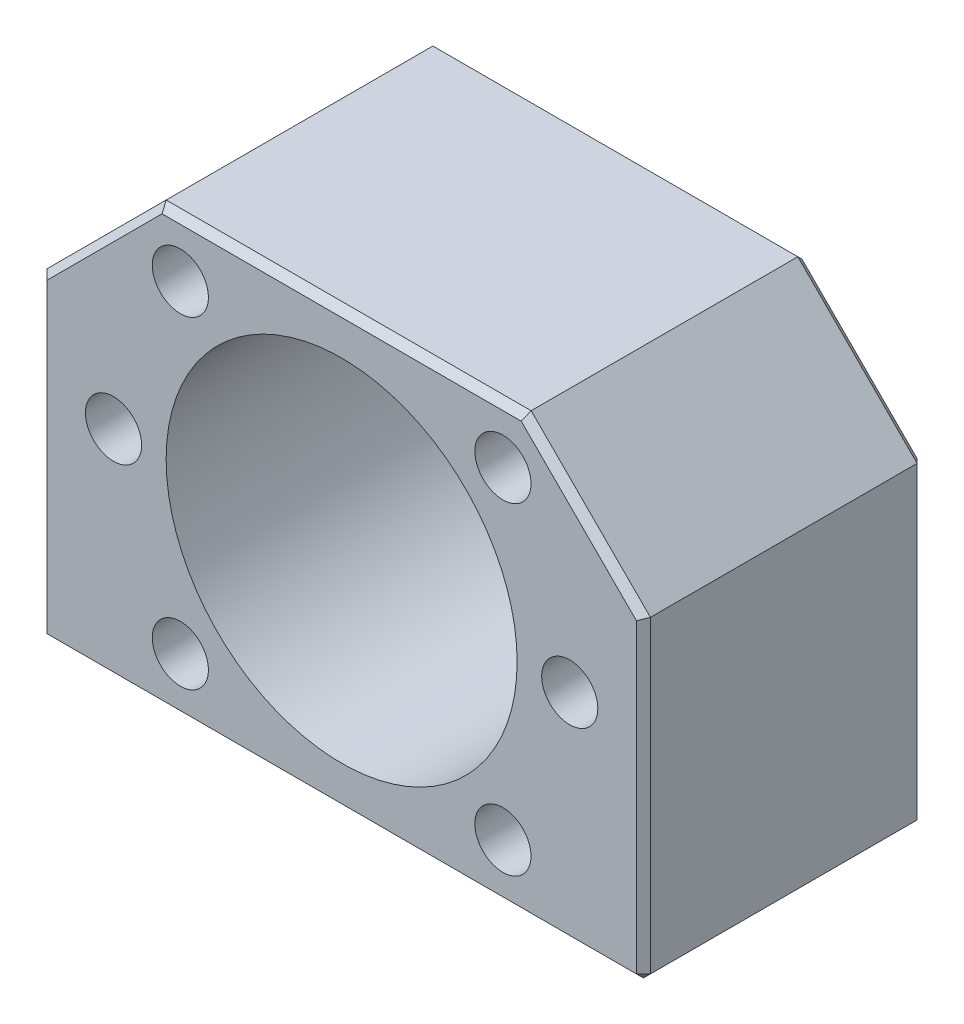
ISO-10303-21;
HEADER;
FILE_DESCRIPTION(('STEP AP214'),'2;1');
FILE_NAME('part.step','',(''),(''),'','','');
FILE_SCHEMA(('AUTOMOTIVE_DESIGN { 1 0 10303 214 1 1 1 1 }'));
ENDSEC;
DATA;
#1=APPLICATION_CONTEXT('core data for automotive mechanical design processes');
#2=APPLICATION_PROTOCOL_DEFINITION('international standard','automotive_design',2000,#1);
#3=PRODUCT_CONTEXT('',#1,'mechanical');
#4=PRODUCT('Part','Part','',(#3));
#5=PRODUCT_RELATED_PRODUCT_CATEGORY('part','',(#4));
#6=PRODUCT_DEFINITION_FORMATION('','',#4);
#7=PRODUCT_DEFINITION_CONTEXT('part definition',#1,'design');
#8=PRODUCT_DEFINITION('design','',#6,#7);
#9=PRODUCT_DEFINITION_SHAPE('','',#8);
#10=(LENGTH_UNIT() NAMED_UNIT(*) SI_UNIT(.MILLI.,.METRE.));
#11=(NAMED_UNIT(*) PLANE_ANGLE_UNIT() SI_UNIT($,.RADIAN.));
#12=(NAMED_UNIT(*) SI_UNIT($,.STERADIAN.) SOLID_ANGLE_UNIT());
#13=UNCERTAINTY_MEASURE_WITH_UNIT(LENGTH_MEASURE(1.E-05),#10,'distance_accuracy_value','');
#14=(GEOMETRIC_REPRESENTATION_CONTEXT(3) GLOBAL_UNCERTAINTY_ASSIGNED_CONTEXT((#13)) GLOBAL_UNIT_ASSIGNED_CONTEXT((#10,
#11,#12)) REPRESENTATION_CONTEXT('',''));
#15=CARTESIAN_POINT('',(0.,0.,0.));
#16=DIRECTION('',(0.,0.,1.));
#17=DIRECTION('',(1.,0.,0.));
#18=AXIS2_PLACEMENT_3D('',#15,#16,#17);
#19=CARTESIAN_POINT('',(0.,0.,0.));
#20=DIRECTION('',(0.,0.,-1.));
#21=DIRECTION('',(1.,0.,0.));
#22=AXIS2_PLACEMENT_3D('',#19,#20,#21);
#23=CYLINDRICAL_SURFACE('',#22,25.005);
#24=CARTESIAN_POINT('',(0.,0.,0.));
#25=DIRECTION('',(0.,0.,-1.));
#26=DIRECTION('',(1.,0.,0.));
#27=AXIS2_PLACEMENT_3D('',#24,#25,#26);
#28=CIRCLE('',#27,25.005);
#29=CARTESIAN_POINT('',(25.005,0.,0.));
#30=VERTEX_POINT('',#29);
#31=CARTESIAN_POINT('',(-25.005,0.,0.));
#32=VERTEX_POINT('',#31);
#33=EDGE_CURVE('E451',#30,#32,#28,.T.);
#34=ORIENTED_EDGE('',*,*,#33,.F.);
#35=CARTESIAN_POINT('',(0.,0.,0.));
#36=DIRECTION('',(0.,0.,-1.));
#37=DIRECTION('',(1.,0.,0.));
#38=AXIS2_PLACEMENT_3D('',#35,#36,#37);
#39=CIRCLE('',#38,25.005);
#40=EDGE_CURVE('E455',#32,#30,#39,.T.);
#41=ORIENTED_EDGE('',*,*,#40,.F.);
#42=DIRECTION('',(0.,0.,-1.));
#43=VECTOR('',#42,1.);
#44=CARTESIAN_POINT('',(-25.005,0.,0.));
#45=LINE('',#44,#43);
#46=CARTESIAN_POINT('',(-25.005,0.,-40.));
#47=VERTEX_POINT('',#46);
#48=EDGE_CURVE('E9',#32,#47,#45,.T.);
#49=ORIENTED_EDGE('',*,*,#48,.T.);
#50=CARTESIAN_POINT('',(0.,0.,-40.));
#51=DIRECTION('',(0.,0.,1.));
#52=DIRECTION('',(1.,0.,0.));
#53=AXIS2_PLACEMENT_3D('',#50,#51,#52);
#54=CIRCLE('',#53,25.005);
#55=CARTESIAN_POINT('',(25.005,0.,-40.));
#56=VERTEX_POINT('',#55);
#57=EDGE_CURVE('E506',#56,#47,#54,.T.);
#58=ORIENTED_EDGE('',*,*,#57,.F.);
#59=CARTESIAN_POINT('',(0.,0.,-40.));
#60=DIRECTION('',(0.,0.,1.));
#61=DIRECTION('',(1.,0.,0.));
#62=AXIS2_PLACEMENT_3D('',#59,#60,#61);
#63=CIRCLE('',#62,25.005);
#64=EDGE_CURVE('E456',#47,#56,#63,.T.);
#65=ORIENTED_EDGE('',*,*,#64,.F.);
#66=ORIENTED_EDGE('',*,*,#48,.F.);
#67=EDGE_LOOP('',(#34,#41,#49,#58,#65,#66));
#68=FACE_BOUND('',#67,.T.);
#69=ADVANCED_FACE('F15',(#68),#23,.F.);
#70=CARTESIAN_POINT('',(-22.9809703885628,22.9809703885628,-18.));
#71=DIRECTION('',(0.,0.,1.));
#72=DIRECTION('',(1.,0.,0.));
#73=AXIS2_PLACEMENT_3D('',#70,#71,#72);
#74=PLANE('',#73);
#75=CARTESIAN_POINT('',(-22.9809703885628,22.9809703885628,-18.));
#76=DIRECTION('',(0.,0.,-1.));
#77=DIRECTION('',(1.,0.,0.));
#78=AXIS2_PLACEMENT_3D('',#75,#76,#77);
#79=CIRCLE('',#78,4.);
#80=CARTESIAN_POINT('',(-18.9809703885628,22.9809703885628,-18.));
#81=VERTEX_POINT('',#80);
#82=CARTESIAN_POINT('',(-26.9809703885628,22.9809703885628,-18.));
#83=VERTEX_POINT('',#82);
#84=EDGE_CURVE('E24',#81,#83,#79,.T.);
#85=ORIENTED_EDGE('',*,*,#84,.F.);
#86=CARTESIAN_POINT('',(-22.9809703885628,22.9809703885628,-18.));
#87=DIRECTION('',(0.,0.,-1.));
#88=DIRECTION('',(1.,0.,0.));
#89=AXIS2_PLACEMENT_3D('',#86,#87,#88);
#90=CIRCLE('',#89,4.);
#91=EDGE_CURVE('E433',#83,#81,#90,.T.);
#92=ORIENTED_EDGE('',*,*,#91,.F.);
#93=EDGE_LOOP('',(#85,#92));
#94=FACE_BOUND('',#93,.T.);
#95=ADVANCED_FACE('F738',(#94),#74,.T.);
#96=CARTESIAN_POINT('',(-22.9809703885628,22.9809703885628,0.));
#97=DIRECTION('',(0.,0.,-1.));
#98=DIRECTION('',(1.,0.,0.));
#99=AXIS2_PLACEMENT_3D('',#96,#97,#98);
#100=CYLINDRICAL_SURFACE('',#99,4.);
#101=CARTESIAN_POINT('',(-22.9809703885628,22.9809703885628,0.));
#102=DIRECTION('',(0.,0.,-1.));
#103=DIRECTION('',(1.,0.,0.));
#104=AXIS2_PLACEMENT_3D('',#101,#102,#103);
#105=CIRCLE('',#104,4.);
#106=CARTESIAN_POINT('',(-18.9809703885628,22.9809703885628,0.));
#107=VERTEX_POINT('',#106);
#108=CARTESIAN_POINT('',(-26.9809703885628,22.9809703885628,0.));
#109=VERTEX_POINT('',#108);
#110=EDGE_CURVE('E614',#107,#109,#105,.T.);
#111=ORIENTED_EDGE('',*,*,#110,.F.);
#112=CARTESIAN_POINT('',(-22.9809703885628,22.9809703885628,0.));
#113=DIRECTION('',(0.,0.,-1.));
#114=DIRECTION('',(1.,0.,0.));
#115=AXIS2_PLACEMENT_3D('',#112,#113,#114);
#116=CIRCLE('',#115,4.);
#117=EDGE_CURVE('E569',#109,#107,#116,.T.);
#118=ORIENTED_EDGE('',*,*,#117,.F.);
#119=DIRECTION('',(0.,0.,-1.));
#120=VECTOR('',#119,1.);
#121=CARTESIAN_POINT('',(-26.9809703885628,22.9809703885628,0.));
#122=LINE('',#121,#120);
#123=EDGE_CURVE('E436',#109,#83,#122,.T.);
#124=ORIENTED_EDGE('',*,*,#123,.T.);
#125=ORIENTED_EDGE('',*,*,#91,.T.);
#126=ORIENTED_EDGE('',*,*,#84,.T.);
#127=ORIENTED_EDGE('',*,*,#123,.F.);
#128=EDGE_LOOP('',(#111,#118,#124,#125,#126,#127));
#129=FACE_BOUND('',#128,.T.);
#130=ADVANCED_FACE('F729',(#129),#100,.F.);
#131=CARTESIAN_POINT('',(22.9809703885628,22.9809703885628,-18.));
#132=DIRECTION('',(0.,0.,1.));
#133=DIRECTION('',(1.,0.,0.));
#134=AXIS2_PLACEMENT_3D('',#131,#132,#133);
#135=PLANE('',#134);
#136=CARTESIAN_POINT('',(22.9809703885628,22.9809703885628,-18.));
#137=DIRECTION('',(0.,0.,-1.));
#138=DIRECTION('',(1.,0.,0.));
#139=AXIS2_PLACEMENT_3D('',#136,#137,#138);
#140=CIRCLE('',#139,4.);
#141=CARTESIAN_POINT('',(26.9809703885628,22.9809703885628,-18.));
#142=VERTEX_POINT('',#141);
#143=CARTESIAN_POINT('',(18.9809703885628,22.9809703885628,-18.));
#144=VERTEX_POINT('',#143);
#145=EDGE_CURVE('E554',#142,#144,#140,.T.);
#146=ORIENTED_EDGE('',*,*,#145,.F.);
#147=CARTESIAN_POINT('',(22.9809703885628,22.9809703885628,-18.));
#148=DIRECTION('',(0.,0.,-1.));
#149=DIRECTION('',(1.,0.,0.));
#150=AXIS2_PLACEMENT_3D('',#147,#148,#149);
#151=CIRCLE('',#150,4.);
#152=EDGE_CURVE('E18',#144,#142,#151,.T.);
#153=ORIENTED_EDGE('',*,*,#152,.F.);
#154=EDGE_LOOP('',(#146,#153));
#155=FACE_BOUND('',#154,.T.);
#156=ADVANCED_FACE('F727',(#155),#135,.T.);
#157=CARTESIAN_POINT('',(22.9809703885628,22.9809703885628,0.));
#158=DIRECTION('',(0.,0.,-1.));
#159=DIRECTION('',(1.,0.,0.));
#160=AXIS2_PLACEMENT_3D('',#157,#158,#159);
#161=CYLINDRICAL_SURFACE('',#160,4.);
#162=CARTESIAN_POINT('',(22.9809703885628,22.9809703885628,0.));
#163=DIRECTION('',(0.,0.,-1.));
#164=DIRECTION('',(1.,0.,0.));
#165=AXIS2_PLACEMENT_3D('',#162,#163,#164);
#166=CIRCLE('',#165,4.);
#167=CARTESIAN_POINT('',(26.9809703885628,22.9809703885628,0.));
#168=VERTEX_POINT('',#167);
#169=CARTESIAN_POINT('',(18.9809703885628,22.9809703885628,0.));
#170=VERTEX_POINT('',#169);
#171=EDGE_CURVE('E564',#168,#170,#166,.T.);
#172=ORIENTED_EDGE('',*,*,#171,.F.);
#173=CARTESIAN_POINT('',(22.9809703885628,22.9809703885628,0.));
#174=DIRECTION('',(0.,0.,-1.));
#175=DIRECTION('',(1.,0.,0.));
#176=AXIS2_PLACEMENT_3D('',#173,#174,#175);
#177=CIRCLE('',#176,4.);
#178=EDGE_CURVE('E568',#170,#168,#177,.T.);
#179=ORIENTED_EDGE('',*,*,#178,.F.);
#180=DIRECTION('',(0.,0.,-1.));
#181=VECTOR('',#180,1.);
#182=CARTESIAN_POINT('',(18.9809703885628,22.9809703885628,0.));
#183=LINE('',#182,#181);
#184=EDGE_CURVE('E712',#170,#144,#183,.T.);
#185=ORIENTED_EDGE('',*,*,#184,.T.);
#186=ORIENTED_EDGE('',*,*,#152,.T.);
#187=ORIENTED_EDGE('',*,*,#145,.T.);
#188=ORIENTED_EDGE('',*,*,#184,.F.);
#189=EDGE_LOOP('',(#172,#179,#185,#186,#187,#188));
#190=FACE_BOUND('',#189,.T.);
#191=ADVANCED_FACE('F725',(#190),#161,.F.);
#192=CARTESIAN_POINT('',(22.9809703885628,-22.9809703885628,-18.));
#193=DIRECTION('',(0.,0.,1.));
#194=DIRECTION('',(1.,0.,0.));
#195=AXIS2_PLACEMENT_3D('',#192,#193,#194);
#196=PLANE('',#195);
#197=CARTESIAN_POINT('',(22.9809703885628,-22.9809703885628,-18.));
#198=DIRECTION('',(0.,0.,-1.));
#199=DIRECTION('',(1.,0.,0.));
#200=AXIS2_PLACEMENT_3D('',#197,#198,#199);
#201=CIRCLE('',#200,4.);
#202=CARTESIAN_POINT('',(26.9809703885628,-22.9809703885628,-18.));
#203=VERTEX_POINT('',#202);
#204=CARTESIAN_POINT('',(18.9809703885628,-22.9809703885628,-18.));
#205=VERTEX_POINT('',#204);
#206=EDGE_CURVE('E710',#203,#205,#201,.T.);
#207=ORIENTED_EDGE('',*,*,#206,.F.);
#208=CARTESIAN_POINT('',(22.9809703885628,-22.9809703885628,-18.));
#209=DIRECTION('',(0.,0.,-1.));
#210=DIRECTION('',(1.,0.,0.));
#211=AXIS2_PLACEMENT_3D('',#208,#209,#210);
#212=CIRCLE('',#211,4.);
#213=EDGE_CURVE('E686',#205,#203,#212,.T.);
#214=ORIENTED_EDGE('',*,*,#213,.F.);
#215=EDGE_LOOP('',(#207,#214));
#216=FACE_BOUND('',#215,.T.);
#217=ADVANCED_FACE('F736',(#216),#196,.T.);
#218=CARTESIAN_POINT('',(22.9809703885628,-22.9809703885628,0.));
#219=DIRECTION('',(0.,0.,-1.));
#220=DIRECTION('',(1.,0.,0.));
#221=AXIS2_PLACEMENT_3D('',#218,#219,#220);
#222=CYLINDRICAL_SURFACE('',#221,4.);
#223=CARTESIAN_POINT('',(22.9809703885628,-22.9809703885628,0.));
#224=DIRECTION('',(0.,0.,-1.));
#225=DIRECTION('',(1.,0.,0.));
#226=AXIS2_PLACEMENT_3D('',#223,#224,#225);
#227=CIRCLE('',#226,4.);
#228=CARTESIAN_POINT('',(26.9809703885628,-22.9809703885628,0.));
#229=VERTEX_POINT('',#228);
#230=CARTESIAN_POINT('',(18.9809703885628,-22.9809703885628,0.));
#231=VERTEX_POINT('',#230);
#232=EDGE_CURVE('E627',#229,#231,#227,.T.);
#233=ORIENTED_EDGE('',*,*,#232,.F.);
#234=CARTESIAN_POINT('',(22.9809703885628,-22.9809703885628,0.));
#235=DIRECTION('',(0.,0.,-1.));
#236=DIRECTION('',(1.,0.,0.));
#237=AXIS2_PLACEMENT_3D('',#234,#235,#236);
#238=CIRCLE('',#237,4.);
#239=EDGE_CURVE('E420',#231,#229,#238,.T.);
#240=ORIENTED_EDGE('',*,*,#239,.F.);
#241=DIRECTION('',(0.,0.,-1.));
#242=VECTOR('',#241,1.);
#243=CARTESIAN_POINT('',(18.9809703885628,-22.9809703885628,0.));
#244=LINE('',#243,#242);
#245=EDGE_CURVE('E512',#231,#205,#244,.T.);
#246=ORIENTED_EDGE('',*,*,#245,.T.);
#247=ORIENTED_EDGE('',*,*,#213,.T.);
#248=ORIENTED_EDGE('',*,*,#206,.T.);
#249=ORIENTED_EDGE('',*,*,#245,.F.);
#250=EDGE_LOOP('',(#233,#240,#246,#247,#248,#249));
#251=FACE_BOUND('',#250,.T.);
#252=ADVANCED_FACE('F1134',(#251),#222,.F.);
#253=CARTESIAN_POINT('',(32.5,0.,-18.));
#254=DIRECTION('',(0.,0.,1.));
#255=DIRECTION('',(1.,0.,0.));
#256=AXIS2_PLACEMENT_3D('',#253,#254,#255);
#257=PLANE('',#256);
#258=CARTESIAN_POINT('',(32.5,0.,-18.));
#259=DIRECTION('',(0.,0.,-1.));
#260=DIRECTION('',(1.,0.,0.));
#261=AXIS2_PLACEMENT_3D('',#258,#259,#260);
#262=CIRCLE('',#261,4.);
#263=CARTESIAN_POINT('',(36.5,0.,-18.));
#264=VERTEX_POINT('',#263);
#265=CARTESIAN_POINT('',(28.5,0.,-18.));
#266=VERTEX_POINT('',#265);
#267=EDGE_CURVE('E400',#264,#266,#262,.T.);
#268=ORIENTED_EDGE('',*,*,#267,.F.);
#269=CARTESIAN_POINT('',(32.5,0.,-18.));
#270=DIRECTION('',(0.,0.,-1.));
#271=DIRECTION('',(1.,0.,0.));
#272=AXIS2_PLACEMENT_3D('',#269,#270,#271);
#273=CIRCLE('',#272,4.);
#274=EDGE_CURVE('E396',#266,#264,#273,.T.);
#275=ORIENTED_EDGE('',*,*,#274,.F.);
#276=EDGE_LOOP('',(#268,#275));
#277=FACE_BOUND('',#276,.T.);
#278=ADVANCED_FACE('F1138',(#277),#257,.T.);
#279=CARTESIAN_POINT('',(32.5,0.,0.));
#280=DIRECTION('',(0.,0.,-1.));
#281=DIRECTION('',(1.,0.,0.));
#282=AXIS2_PLACEMENT_3D('',#279,#280,#281);
#283=CYLINDRICAL_SURFACE('',#282,4.);
#284=CARTESIAN_POINT('',(32.5,0.,0.));
#285=DIRECTION('',(0.,0.,-1.));
#286=DIRECTION('',(1.,0.,0.));
#287=AXIS2_PLACEMENT_3D('',#284,#285,#286);
#288=CIRCLE('',#287,4.);
#289=CARTESIAN_POINT('',(36.5,0.,0.));
#290=VERTEX_POINT('',#289);
#291=CARTESIAN_POINT('',(28.5,0.,0.));
#292=VERTEX_POINT('',#291);
#293=EDGE_CURVE('E416',#290,#292,#288,.T.);
#294=ORIENTED_EDGE('',*,*,#293,.F.);
#295=CARTESIAN_POINT('',(32.5,0.,0.));
#296=DIRECTION('',(0.,0.,-1.));
#297=DIRECTION('',(1.,0.,0.));
#298=AXIS2_PLACEMENT_3D('',#295,#296,#297);
#299=CIRCLE('',#298,4.);
#300=EDGE_CURVE('E384',#292,#290,#299,.T.);
#301=ORIENTED_EDGE('',*,*,#300,.F.);
#302=DIRECTION('',(0.,0.,-1.));
#303=VECTOR('',#302,1.);
#304=CARTESIAN_POINT('',(28.5,0.,0.));
#305=LINE('',#304,#303);
#306=EDGE_CURVE('E371',#292,#266,#305,.T.);
#307=ORIENTED_EDGE('',*,*,#306,.T.);
#308=ORIENTED_EDGE('',*,*,#274,.T.);
#309=ORIENTED_EDGE('',*,*,#267,.T.);
#310=ORIENTED_EDGE('',*,*,#306,.F.);
#311=EDGE_LOOP('',(#294,#301,#307,#308,#309,#310));
#312=FACE_BOUND('',#311,.T.);
#313=ADVANCED_FACE('F1147',(#312),#283,.F.);
#314=CARTESIAN_POINT('',(-22.9809703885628,-22.9809703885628,-18.));
#315=DIRECTION('',(0.,0.,1.));
#316=DIRECTION('',(1.,0.,0.));
#317=AXIS2_PLACEMENT_3D('',#314,#315,#316);
#318=PLANE('',#317);
#319=CARTESIAN_POINT('',(-22.9809703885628,-22.9809703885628,-18.));
#320=DIRECTION('',(0.,0.,-1.));
#321=DIRECTION('',(1.,0.,0.));
#322=AXIS2_PLACEMENT_3D('',#319,#320,#321);
#323=CIRCLE('',#322,4.);
#324=CARTESIAN_POINT('',(-18.9809703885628,-22.9809703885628,-18.));
#325=VERTEX_POINT('',#324);
#326=CARTESIAN_POINT('',(-26.9809703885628,-22.9809703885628,-18.));
#327=VERTEX_POINT('',#326);
#328=EDGE_CURVE('E368',#325,#327,#323,.T.);
#329=ORIENTED_EDGE('',*,*,#328,.F.);
#330=CARTESIAN_POINT('',(-22.9809703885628,-22.9809703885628,-18.));
#331=DIRECTION('',(0.,0.,-1.));
#332=DIRECTION('',(1.,0.,0.));
#333=AXIS2_PLACEMENT_3D('',#330,#331,#332);
#334=CIRCLE('',#333,4.);
#335=EDGE_CURVE('E372',#327,#325,#334,.T.);
#336=ORIENTED_EDGE('',*,*,#335,.F.);
#337=EDGE_LOOP('',(#329,#336));
#338=FACE_BOUND('',#337,.T.);
#339=ADVANCED_FACE('F1156',(#338),#318,.T.);
#340=CARTESIAN_POINT('',(-22.9809703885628,-22.9809703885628,0.));
#341=DIRECTION('',(0.,0.,-1.));
#342=DIRECTION('',(1.,0.,0.));
#343=AXIS2_PLACEMENT_3D('',#340,#341,#342);
#344=CYLINDRICAL_SURFACE('',#343,4.);
#345=CARTESIAN_POINT('',(-22.9809703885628,-22.9809703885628,0.));
#346=DIRECTION('',(0.,0.,-1.));
#347=DIRECTION('',(1.,0.,0.));
#348=AXIS2_PLACEMENT_3D('',#345,#346,#347);
#349=CIRCLE('',#348,4.);
#350=CARTESIAN_POINT('',(-18.9809703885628,-22.9809703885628,0.));
#351=VERTEX_POINT('',#350);
#352=CARTESIAN_POINT('',(-26.9809703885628,-22.9809703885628,0.));
#353=VERTEX_POINT('',#352);
#354=EDGE_CURVE('E379',#351,#353,#349,.T.);
#355=ORIENTED_EDGE('',*,*,#354,.F.);
#356=CARTESIAN_POINT('',(-22.9809703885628,-22.9809703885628,0.));
#357=DIRECTION('',(0.,0.,-1.));
#358=DIRECTION('',(1.,0.,0.));
#359=AXIS2_PLACEMENT_3D('',#356,#357,#358);
#360=CIRCLE('',#359,4.);
#361=EDGE_CURVE('E383',#353,#351,#360,.T.);
#362=ORIENTED_EDGE('',*,*,#361,.F.);
#363=DIRECTION('',(0.,0.,-1.));
#364=VECTOR('',#363,1.);
#365=CARTESIAN_POINT('',(-26.9809703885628,-22.9809703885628,0.));
#366=LINE('',#365,#364);
#367=EDGE_CURVE('E607',#353,#327,#366,.T.);
#368=ORIENTED_EDGE('',*,*,#367,.T.);
#369=ORIENTED_EDGE('',*,*,#335,.T.);
#370=ORIENTED_EDGE('',*,*,#328,.T.);
#371=ORIENTED_EDGE('',*,*,#367,.F.);
#372=EDGE_LOOP('',(#355,#362,#368,#369,#370,#371));
#373=FACE_BOUND('',#372,.T.);
#374=ADVANCED_FACE('F1165',(#373),#344,.F.);
#375=CARTESIAN_POINT('',(-32.5,0.,-18.));
#376=DIRECTION('',(0.,0.,1.));
#377=DIRECTION('',(1.,0.,0.));
#378=AXIS2_PLACEMENT_3D('',#375,#376,#377);
#379=PLANE('',#378);
#380=CARTESIAN_POINT('',(-32.5,0.,-18.));
#381=DIRECTION('',(0.,0.,-1.));
#382=DIRECTION('',(1.,0.,0.));
#383=AXIS2_PLACEMENT_3D('',#380,#381,#382);
#384=CIRCLE('',#383,4.);
#385=CARTESIAN_POINT('',(-28.5,0.,-18.));
#386=VERTEX_POINT('',#385);
#387=CARTESIAN_POINT('',(-36.5,0.,-18.));
#388=VERTEX_POINT('',#387);
#389=EDGE_CURVE('E611',#386,#388,#384,.T.);
#390=ORIENTED_EDGE('',*,*,#389,.F.);
#391=CARTESIAN_POINT('',(-32.5,0.,-18.));
#392=DIRECTION('',(0.,0.,-1.));
#393=DIRECTION('',(1.,0.,0.));
#394=AXIS2_PLACEMENT_3D('',#391,#392,#393);
#395=CIRCLE('',#394,4.);
#396=EDGE_CURVE('E670',#388,#386,#395,.T.);
#397=ORIENTED_EDGE('',*,*,#396,.F.);
#398=EDGE_LOOP('',(#390,#397));
#399=FACE_BOUND('',#398,.T.);
#400=ADVANCED_FACE('F1171',(#399),#379,.T.);
#401=CARTESIAN_POINT('',(-32.5,0.,0.));
#402=DIRECTION('',(0.,0.,-1.));
#403=DIRECTION('',(1.,0.,0.));
#404=AXIS2_PLACEMENT_3D('',#401,#402,#403);
#405=CYLINDRICAL_SURFACE('',#404,4.);
#406=CARTESIAN_POINT('',(-32.5,0.,0.));
#407=DIRECTION('',(0.,0.,-1.));
#408=DIRECTION('',(1.,0.,0.));
#409=AXIS2_PLACEMENT_3D('',#406,#407,#408);
#410=CIRCLE('',#409,4.);
#411=CARTESIAN_POINT('',(-28.5,0.,0.));
#412=VERTEX_POINT('',#411);
#413=CARTESIAN_POINT('',(-36.5,0.,0.));
#414=VERTEX_POINT('',#413);
#415=EDGE_CURVE('E642',#412,#414,#410,.T.);
#416=ORIENTED_EDGE('',*,*,#415,.F.);
#417=CARTESIAN_POINT('',(-32.5,0.,0.));
#418=DIRECTION('',(0.,0.,-1.));
#419=DIRECTION('',(1.,0.,0.));
#420=AXIS2_PLACEMENT_3D('',#417,#418,#419);
#421=CIRCLE('',#420,4.);
#422=EDGE_CURVE('E650',#414,#412,#421,.T.);
#423=ORIENTED_EDGE('',*,*,#422,.F.);
#424=DIRECTION('',(0.,0.,-1.));
#425=VECTOR('',#424,1.);
#426=CARTESIAN_POINT('',(-36.5,0.,0.));
#427=LINE('',#426,#425);
#428=EDGE_CURVE('E666',#414,#388,#427,.T.);
#429=ORIENTED_EDGE('',*,*,#428,.T.);
#430=ORIENTED_EDGE('',*,*,#396,.T.);
#431=ORIENTED_EDGE('',*,*,#389,.T.);
#432=ORIENTED_EDGE('',*,*,#428,.F.);
#433=EDGE_LOOP('',(#416,#423,#429,#430,#431,#432));
#434=FACE_BOUND('',#433,.T.);
#435=ADVANCED_FACE('F1175',(#434),#405,.F.);
#436=CARTESIAN_POINT('',(43.,31.,0.));
#437=DIRECTION('',(1.,0.,0.));
#438=DIRECTION('',(0.,1.,0.));
#439=AXIS2_PLACEMENT_3D('',#436,#437,#438);
#440=PLANE('',#439);
#441=DIRECTION('',(0.,-1.,0.));
#442=VECTOR('',#441,1.);
#443=CARTESIAN_POINT('',(43.,15.5,-39.));
#444=LINE('',#443,#442);
#445=CARTESIAN_POINT('',(43.,14.,-39.));
#446=VERTEX_POINT('',#445);
#447=CARTESIAN_POINT('',(43.,-30.,-39.));
#448=VERTEX_POINT('',#447);
#449=EDGE_CURVE('E535',#446,#448,#444,.T.);
#450=ORIENTED_EDGE('',*,*,#449,.F.);
#451=DIRECTION('',(0.,0.,-1.));
#452=VECTOR('',#451,1.);
#453=CARTESIAN_POINT('',(43.,14.,0.));
#454=LINE('',#453,#452);
#455=CARTESIAN_POINT('',(43.,14.,-1.));
#456=VERTEX_POINT('',#455);
#457=EDGE_CURVE('E386',#456,#446,#454,.T.);
#458=ORIENTED_EDGE('',*,*,#457,.F.);
#459=DIRECTION('',(0.,1.,0.));
#460=VECTOR('',#459,1.);
#461=CARTESIAN_POINT('',(43.,15.5,-1.));
#462=LINE('',#461,#460);
#463=CARTESIAN_POINT('',(43.,-30.,-1.));
#464=VERTEX_POINT('',#463);
#465=EDGE_CURVE('E479',#464,#456,#462,.T.);
#466=ORIENTED_EDGE('',*,*,#465,.F.);
#467=DIRECTION('',(0.,0.,1.));
#468=VECTOR('',#467,1.);
#469=CARTESIAN_POINT('',(43.,-30.,0.));
#470=LINE('',#469,#468);
#471=EDGE_CURVE('E465',#448,#464,#470,.T.);
#472=ORIENTED_EDGE('',*,*,#471,.F.);
#473=EDGE_LOOP('',(#450,#458,#466,#472));
#474=FACE_BOUND('',#473,.T.);
#475=ADVANCED_FACE('F1184',(#474),#440,.T.);
#476=CARTESIAN_POINT('',(33.,-13.,-8.));
#477=DIRECTION('',(0.,-1.,0.));
#478=DIRECTION('',(0.,0.,-1.));
#479=AXIS2_PLACEMENT_3D('',#476,#477,#478);
#480=PLANE('',#479);
#481=CARTESIAN_POINT('',(33.,-13.,-8.));
#482=DIRECTION('',(0.,1.,0.));
#483=DIRECTION('',(1.,0.,0.));
#484=AXIS2_PLACEMENT_3D('',#481,#482,#483);
#485=CIRCLE('',#484,4.);
#486=CARTESIAN_POINT('',(37.,-13.,-8.));
#487=VERTEX_POINT('',#486);
#488=CARTESIAN_POINT('',(29.,-13.,-8.));
#489=VERTEX_POINT('',#488);
#490=EDGE_CURVE('E671',#487,#489,#485,.T.);
#491=ORIENTED_EDGE('',*,*,#490,.F.);
#492=CARTESIAN_POINT('',(33.,-13.,-8.));
#493=DIRECTION('',(0.,1.,0.));
#494=DIRECTION('',(1.,0.,0.));
#495=AXIS2_PLACEMENT_3D('',#492,#493,#494);
#496=CIRCLE('',#495,4.);
#497=EDGE_CURVE('E593',#489,#487,#496,.T.);
#498=ORIENTED_EDGE('',*,*,#497,.F.);
#499=EDGE_LOOP('',(#491,#498));
#500=FACE_BOUND('',#499,.T.);
#501=ADVANCED_FACE('F1193',(#500),#480,.T.);
#502=CARTESIAN_POINT('',(33.,-31.,-8.));
#503=DIRECTION('',(0.,1.,0.));
#504=DIRECTION('',(1.,0.,0.));
#505=AXIS2_PLACEMENT_3D('',#502,#503,#504);
#506=CYLINDRICAL_SURFACE('',#505,4.);
#507=CARTESIAN_POINT('',(33.,-31.,-8.));
#508=DIRECTION('',(0.,1.,0.));
#509=DIRECTION('',(1.,0.,0.));
#510=AXIS2_PLACEMENT_3D('',#507,#508,#509);
#511=CIRCLE('',#510,4.);
#512=CARTESIAN_POINT('',(37.,-31.,-8.));
#513=VERTEX_POINT('',#512);
#514=CARTESIAN_POINT('',(29.,-31.,-8.));
#515=VERTEX_POINT('',#514);
#516=EDGE_CURVE('E653',#513,#515,#511,.T.);
#517=ORIENTED_EDGE('',*,*,#516,.F.);
#518=CARTESIAN_POINT('',(33.,-31.,-8.));
#519=DIRECTION('',(0.,1.,0.));
#520=DIRECTION('',(1.,0.,0.));
#521=AXIS2_PLACEMENT_3D('',#518,#519,#520);
#522=CIRCLE('',#521,4.);
#523=EDGE_CURVE('E657',#515,#513,#522,.T.);
#524=ORIENTED_EDGE('',*,*,#523,.F.);
#525=DIRECTION('',(0.,1.,0.));
#526=VECTOR('',#525,1.);
#527=CARTESIAN_POINT('',(29.,-31.,-8.));
#528=LINE('',#527,#526);
#529=EDGE_CURVE('E589',#515,#489,#528,.T.);
#530=ORIENTED_EDGE('',*,*,#529,.T.);
#531=ORIENTED_EDGE('',*,*,#497,.T.);
#532=ORIENTED_EDGE('',*,*,#490,.T.);
#533=ORIENTED_EDGE('',*,*,#529,.F.);
#534=EDGE_LOOP('',(#517,#524,#530,#531,#532,#533));
#535=FACE_BOUND('',#534,.T.);
#536=ADVANCED_FACE('F1202',(#535),#506,.F.);
#537=CARTESIAN_POINT('',(-33.,-13.,-32.));
#538=DIRECTION('',(0.,-1.,0.));
#539=DIRECTION('',(0.,0.,-1.));
#540=AXIS2_PLACEMENT_3D('',#537,#538,#539);
#541=PLANE('',#540);
#542=CARTESIAN_POINT('',(-33.,-13.,-32.));
#543=DIRECTION('',(0.,1.,0.));
#544=DIRECTION('',(1.,0.,0.));
#545=AXIS2_PLACEMENT_3D('',#542,#543,#544);
#546=CIRCLE('',#545,4.);
#547=CARTESIAN_POINT('',(-29.,-13.,-32.));
#548=VERTEX_POINT('',#547);
#549=CARTESIAN_POINT('',(-37.,-13.,-32.));
#550=VERTEX_POINT('',#549);
#551=EDGE_CURVE('E547',#548,#550,#546,.T.);
#552=ORIENTED_EDGE('',*,*,#551,.F.);
#553=CARTESIAN_POINT('',(-33.,-13.,-32.));
#554=DIRECTION('',(0.,1.,0.));
#555=DIRECTION('',(1.,0.,0.));
#556=AXIS2_PLACEMENT_3D('',#553,#554,#555);
#557=CIRCLE('',#556,4.);
#558=EDGE_CURVE('E543',#550,#548,#557,.T.);
#559=ORIENTED_EDGE('',*,*,#558,.F.);
#560=EDGE_LOOP('',(#552,#559));
#561=FACE_BOUND('',#560,.T.);
#562=ADVANCED_FACE('F1215',(#561),#541,.T.);
#563=CARTESIAN_POINT('',(-33.,-31.,-32.));
#564=DIRECTION('',(0.,1.,0.));
#565=DIRECTION('',(1.,0.,0.));
#566=AXIS2_PLACEMENT_3D('',#563,#564,#565);
#567=CYLINDRICAL_SURFACE('',#566,4.);
#568=CARTESIAN_POINT('',(-33.,-31.,-32.));
#569=DIRECTION('',(0.,1.,0.));
#570=DIRECTION('',(1.,0.,0.));
#571=AXIS2_PLACEMENT_3D('',#568,#569,#570);
#572=CIRCLE('',#571,4.);
#573=CARTESIAN_POINT('',(-29.,-31.,-32.));
#574=VERTEX_POINT('',#573);
#575=CARTESIAN_POINT('',(-37.,-31.,-32.));
#576=VERTEX_POINT('',#575);
#577=EDGE_CURVE('E503',#574,#576,#572,.T.);
#578=ORIENTED_EDGE('',*,*,#577,.F.);
#579=CARTESIAN_POINT('',(-33.,-31.,-32.));
#580=DIRECTION('',(0.,1.,0.));
#581=DIRECTION('',(1.,0.,0.));
#582=AXIS2_PLACEMENT_3D('',#579,#580,#581);
#583=CIRCLE('',#582,4.);
#584=EDGE_CURVE('E499',#576,#574,#583,.T.);
#585=ORIENTED_EDGE('',*,*,#584,.F.);
#586=DIRECTION('',(0.,1.,0.));
#587=VECTOR('',#586,1.);
#588=CARTESIAN_POINT('',(-37.,-31.,-32.));
#589=LINE('',#588,#587);
#590=EDGE_CURVE('E463',#576,#550,#589,.T.);
#591=ORIENTED_EDGE('',*,*,#590,.T.);
#592=ORIENTED_EDGE('',*,*,#558,.T.);
#593=ORIENTED_EDGE('',*,*,#551,.T.);
#594=ORIENTED_EDGE('',*,*,#590,.F.);
#595=EDGE_LOOP('',(#578,#585,#591,#592,#593,#594));
#596=FACE_BOUND('',#595,.T.);
#597=ADVANCED_FACE('F1223',(#596),#567,.F.);
#598=CARTESIAN_POINT('',(33.,-13.,-32.));
#599=DIRECTION('',(0.,-1.,0.));
#600=DIRECTION('',(0.,0.,-1.));
#601=AXIS2_PLACEMENT_3D('',#598,#599,#600);
#602=PLANE('',#601);
#603=CARTESIAN_POINT('',(33.,-13.,-32.));
#604=DIRECTION('',(0.,1.,0.));
#605=DIRECTION('',(1.,0.,0.));
#606=AXIS2_PLACEMENT_3D('',#603,#604,#605);
#607=CIRCLE('',#606,4.);
#608=CARTESIAN_POINT('',(37.,-13.,-32.));
#609=VERTEX_POINT('',#608);
#610=CARTESIAN_POINT('',(29.,-13.,-32.));
#611=VERTEX_POINT('',#610);
#612=EDGE_CURVE('E460',#609,#611,#607,.T.);
#613=ORIENTED_EDGE('',*,*,#612,.F.);
#614=CARTESIAN_POINT('',(33.,-13.,-32.));
#615=DIRECTION('',(0.,1.,0.));
#616=DIRECTION('',(1.,0.,0.));
#617=AXIS2_PLACEMENT_3D('',#614,#615,#616);
#618=CIRCLE('',#617,4.);
#619=EDGE_CURVE('E464',#611,#609,#618,.T.);
#620=ORIENTED_EDGE('',*,*,#619,.F.);
#621=EDGE_LOOP('',(#613,#620));
#622=FACE_BOUND('',#621,.T.);
#623=ADVANCED_FACE('F1232',(#622),#602,.T.);
#624=CARTESIAN_POINT('',(33.,-31.,-32.));
#625=DIRECTION('',(0.,1.,0.));
#626=DIRECTION('',(1.,0.,0.));
#627=AXIS2_PLACEMENT_3D('',#624,#625,#626);
#628=CYLINDRICAL_SURFACE('',#627,4.);
#629=CARTESIAN_POINT('',(33.,-31.,-32.));
#630=DIRECTION('',(0.,1.,0.));
#631=DIRECTION('',(1.,0.,0.));
#632=AXIS2_PLACEMENT_3D('',#629,#630,#631);
#633=CIRCLE('',#632,4.);
#634=CARTESIAN_POINT('',(37.,-31.,-32.));
#635=VERTEX_POINT('',#634);
#636=CARTESIAN_POINT('',(29.,-31.,-32.));
#637=VERTEX_POINT('',#636);
#638=EDGE_CURVE('E502',#635,#637,#633,.T.);
#639=ORIENTED_EDGE('',*,*,#638,.F.);
#640=CARTESIAN_POINT('',(33.,-31.,-32.));
#641=DIRECTION('',(0.,1.,0.));
#642=DIRECTION('',(1.,0.,0.));
#643=AXIS2_PLACEMENT_3D('',#640,#641,#642);
#644=CIRCLE('',#643,4.);
#645=EDGE_CURVE('E524',#637,#635,#644,.T.);
#646=ORIENTED_EDGE('',*,*,#645,.F.);
#647=DIRECTION('',(0.,1.,0.));
#648=VECTOR('',#647,1.);
#649=CARTESIAN_POINT('',(29.,-31.,-32.));
#650=LINE('',#649,#648);
#651=EDGE_CURVE('E643',#637,#611,#650,.T.);
#652=ORIENTED_EDGE('',*,*,#651,.T.);
#653=ORIENTED_EDGE('',*,*,#619,.T.);
#654=ORIENTED_EDGE('',*,*,#612,.T.);
#655=ORIENTED_EDGE('',*,*,#651,.F.);
#656=EDGE_LOOP('',(#639,#646,#652,#653,#654,#655));
#657=FACE_BOUND('',#656,.T.);
#658=ADVANCED_FACE('F1241',(#657),#628,.F.);
#659=CARTESIAN_POINT('',(-33.,-13.,-8.));
#660=DIRECTION('',(0.,-1.,0.));
#661=DIRECTION('',(0.,0.,-1.));
#662=AXIS2_PLACEMENT_3D('',#659,#660,#661);
#663=PLANE('',#662);
#664=CARTESIAN_POINT('',(-33.,-13.,-8.));
#665=DIRECTION('',(0.,1.,0.));
#666=DIRECTION('',(1.,0.,0.));
#667=AXIS2_PLACEMENT_3D('',#664,#665,#666);
#668=CIRCLE('',#667,4.);
#669=CARTESIAN_POINT('',(-29.,-13.,-8.));
#670=VERTEX_POINT('',#669);
#671=CARTESIAN_POINT('',(-37.,-13.,-8.));
#672=VERTEX_POINT('',#671);
#673=EDGE_CURVE('E637',#670,#672,#668,.T.);
#674=ORIENTED_EDGE('',*,*,#673,.F.);
#675=CARTESIAN_POINT('',(-33.,-13.,-8.));
#676=DIRECTION('',(0.,1.,0.));
#677=DIRECTION('',(1.,0.,0.));
#678=AXIS2_PLACEMENT_3D('',#675,#676,#677);
#679=CIRCLE('',#678,4.);
#680=EDGE_CURVE('E633',#672,#670,#679,.T.);
#681=ORIENTED_EDGE('',*,*,#680,.F.);
#682=EDGE_LOOP('',(#674,#681));
#683=FACE_BOUND('',#682,.T.);
#684=ADVANCED_FACE('F1247',(#683),#663,.T.);
#685=CARTESIAN_POINT('',(-33.,-31.,-8.));
#686=DIRECTION('',(0.,1.,0.));
#687=DIRECTION('',(1.,0.,0.));
#688=AXIS2_PLACEMENT_3D('',#685,#686,#687);
#689=CYLINDRICAL_SURFACE('',#688,4.);
#690=CARTESIAN_POINT('',(-33.,-31.,-8.));
#691=DIRECTION('',(0.,1.,0.));
#692=DIRECTION('',(1.,0.,0.));
#693=AXIS2_PLACEMENT_3D('',#690,#691,#692);
#694=CIRCLE('',#693,4.);
#695=CARTESIAN_POINT('',(-29.,-31.,-8.));
#696=VERTEX_POINT('',#695);
#697=CARTESIAN_POINT('',(-37.,-31.,-8.));
#698=VERTEX_POINT('',#697);
#699=EDGE_CURVE('E484',#696,#698,#694,.T.);
#700=ORIENTED_EDGE('',*,*,#699,.F.);
#701=CARTESIAN_POINT('',(-33.,-31.,-8.));
#702=DIRECTION('',(0.,1.,0.));
#703=DIRECTION('',(1.,0.,0.));
#704=AXIS2_PLACEMENT_3D('',#701,#702,#703);
#705=CIRCLE('',#704,4.);
#706=EDGE_CURVE('E480',#698,#696,#705,.T.);
#707=ORIENTED_EDGE('',*,*,#706,.F.);
#708=DIRECTION('',(0.,1.,0.));
#709=VECTOR('',#708,1.);
#710=CARTESIAN_POINT('',(-37.,-31.,-8.));
#711=LINE('',#710,#709);
#712=EDGE_CURVE('E483',#698,#672,#711,.T.);
#713=ORIENTED_EDGE('',*,*,#712,.T.);
#714=ORIENTED_EDGE('',*,*,#680,.T.);
#715=ORIENTED_EDGE('',*,*,#673,.T.);
#716=ORIENTED_EDGE('',*,*,#712,.F.);
#717=EDGE_LOOP('',(#700,#707,#713,#714,#715,#716));
#718=FACE_BOUND('',#717,.T.);
#719=ADVANCED_FACE('F1251',(#718),#689,.F.);
#720=CARTESIAN_POINT('',(43.,-31.,0.));
#721=DIRECTION('',(0.,-1.,0.));
#722=DIRECTION('',(0.,0.,-1.));
#723=AXIS2_PLACEMENT_3D('',#720,#721,#722);
#724=PLANE('',#723);
#725=ORIENTED_EDGE('',*,*,#699,.T.);
#726=ORIENTED_EDGE('',*,*,#706,.T.);
#727=EDGE_LOOP('',(#725,#726));
#728=FACE_BOUND('',#727,.T.);
#729=ORIENTED_EDGE('',*,*,#638,.T.);
#730=ORIENTED_EDGE('',*,*,#645,.T.);
#731=EDGE_LOOP('',(#729,#730));
#732=FACE_BOUND('',#731,.T.);
#733=ORIENTED_EDGE('',*,*,#577,.T.);
#734=ORIENTED_EDGE('',*,*,#584,.T.);
#735=EDGE_LOOP('',(#733,#734));
#736=FACE_BOUND('',#735,.T.);
#737=ORIENTED_EDGE('',*,*,#516,.T.);
#738=ORIENTED_EDGE('',*,*,#523,.T.);
#739=EDGE_LOOP('',(#737,#738));
#740=FACE_BOUND('',#739,.T.);
#741=DIRECTION('',(0.,0.,1.));
#742=VECTOR('',#741,1.);
#743=CARTESIAN_POINT('',(-42.,-31.,0.));
#744=LINE('',#743,#742);
#745=CARTESIAN_POINT('',(-42.,-31.,-39.));
#746=VERTEX_POINT('',#745);
#747=CARTESIAN_POINT('',(-42.,-31.,-1.));
#748=VERTEX_POINT('',#747);
#749=EDGE_CURVE('E530',#746,#748,#744,.T.);
#750=ORIENTED_EDGE('',*,*,#749,.F.);
#751=DIRECTION('',(-1.,0.,0.));
#752=VECTOR('',#751,1.);
#753=CARTESIAN_POINT('',(21.5,-31.,-39.));
#754=LINE('',#753,#752);
#755=CARTESIAN_POINT('',(42.,-31.,-39.));
#756=VERTEX_POINT('',#755);
#757=EDGE_CURVE('E582',#756,#746,#754,.T.);
#758=ORIENTED_EDGE('',*,*,#757,.F.);
#759=DIRECTION('',(0.,0.,-1.));
#760=VECTOR('',#759,1.);
#761=CARTESIAN_POINT('',(42.,-31.,0.));
#762=LINE('',#761,#760);
#763=CARTESIAN_POINT('',(42.,-31.,-1.));
#764=VERTEX_POINT('',#763);
#765=EDGE_CURVE('E468',#764,#756,#762,.T.);
#766=ORIENTED_EDGE('',*,*,#765,.F.);
#767=DIRECTION('',(1.,0.,0.));
#768=VECTOR('',#767,1.);
#769=CARTESIAN_POINT('',(21.5,-31.,-1.));
#770=LINE('',#769,#768);
#771=EDGE_CURVE('E550',#748,#764,#770,.T.);
#772=ORIENTED_EDGE('',*,*,#771,.F.);
#773=EDGE_LOOP('',(#750,#758,#766,#772));
#774=FACE_BOUND('',#773,.T.);
#775=ADVANCED_FACE('F754',(#728,#732,#736,#740,#774),#724,.T.);
#776=CARTESIAN_POINT('',(0.,0.,0.));
#777=DIRECTION('',(0.,0.,1.));
#778=DIRECTION('',(1.,0.,0.));
#779=AXIS2_PLACEMENT_3D('',#776,#777,#778);
#780=PLANE('',#779);
#781=ORIENTED_EDGE('',*,*,#415,.T.);
#782=ORIENTED_EDGE('',*,*,#422,.T.);
#783=EDGE_LOOP('',(#781,#782));
#784=FACE_BOUND('',#783,.T.);
#785=ORIENTED_EDGE('',*,*,#354,.T.);
#786=ORIENTED_EDGE('',*,*,#361,.T.);
#787=EDGE_LOOP('',(#785,#786));
#788=FACE_BOUND('',#787,.T.);
#789=ORIENTED_EDGE('',*,*,#293,.T.);
#790=ORIENTED_EDGE('',*,*,#300,.T.);
#791=EDGE_LOOP('',(#789,#790));
#792=FACE_BOUND('',#791,.T.);
#793=ORIENTED_EDGE('',*,*,#232,.T.);
#794=ORIENTED_EDGE('',*,*,#239,.T.);
#795=EDGE_LOOP('',(#793,#794));
#796=FACE_BOUND('',#795,.T.);
#797=ORIENTED_EDGE('',*,*,#171,.T.);
#798=ORIENTED_EDGE('',*,*,#178,.T.);
#799=EDGE_LOOP('',(#797,#798));
#800=FACE_BOUND('',#799,.T.);
#801=ORIENTED_EDGE('',*,*,#110,.T.);
#802=ORIENTED_EDGE('',*,*,#117,.T.);
#803=EDGE_LOOP('',(#801,#802));
#804=FACE_BOUND('',#803,.T.);
#805=ORIENTED_EDGE('',*,*,#33,.T.);
#806=ORIENTED_EDGE('',*,*,#40,.T.);
#807=EDGE_LOOP('',(#805,#806));
#808=FACE_BOUND('',#807,.T.);
#809=DIRECTION('',(0.,1.,0.));
#810=VECTOR('',#809,1.);
#811=CARTESIAN_POINT('',(-42.,-15.5,0.));
#812=LINE('',#811,#810);
#813=CARTESIAN_POINT('',(-42.,-30.,0.));
#814=VERTEX_POINT('',#813);
#815=CARTESIAN_POINT('',(-42.,13.5857864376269,0.));
#816=VERTEX_POINT('',#815);
#817=EDGE_CURVE('E426',#814,#816,#812,.T.);
#818=ORIENTED_EDGE('',*,*,#817,.F.);
#819=DIRECTION('',(-1.,0.,0.));
#820=VECTOR('',#819,1.);
#821=CARTESIAN_POINT('',(21.5,-30.,0.));
#822=LINE('',#821,#820);
#823=CARTESIAN_POINT('',(42.,-30.,0.));
#824=VERTEX_POINT('',#823);
#825=EDGE_CURVE('E542',#824,#814,#822,.T.);
#826=ORIENTED_EDGE('',*,*,#825,.F.);
#827=DIRECTION('',(0.,-1.,0.));
#828=VECTOR('',#827,1.);
#829=CARTESIAN_POINT('',(42.,15.5,0.));
#830=LINE('',#829,#828);
#831=CARTESIAN_POINT('',(42.,13.5857864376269,0.));
#832=VERTEX_POINT('',#831);
#833=EDGE_CURVE('E472',#832,#824,#830,.T.);
#834=ORIENTED_EDGE('',*,*,#833,.F.);
#835=DIRECTION('',(0.707106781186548,-0.707106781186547,0.));
#836=VECTOR('',#835,1.);
#837=CARTESIAN_POINT('',(30.7928932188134,24.7928932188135,0.));
#838=LINE('',#837,#836);
#839=CARTESIAN_POINT('',(25.5857864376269,30.,0.));
#840=VERTEX_POINT('',#839);
#841=EDGE_CURVE('E538',#840,#832,#838,.T.);
#842=ORIENTED_EDGE('',*,*,#841,.F.);
#843=DIRECTION('',(1.,0.,0.));
#844=VECTOR('',#843,1.);
#845=CARTESIAN_POINT('',(-21.5,30.,0.));
#846=LINE('',#845,#844);
#847=CARTESIAN_POINT('',(-25.5857864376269,30.,0.));
#848=VERTEX_POINT('',#847);
#849=EDGE_CURVE('E373',#848,#840,#846,.T.);
#850=ORIENTED_EDGE('',*,*,#849,.F.);
#851=DIRECTION('',(0.707106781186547,0.707106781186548,0.));
#852=VECTOR('',#851,1.);
#853=CARTESIAN_POINT('',(-30.7928932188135,24.7928932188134,0.));
#854=LINE('',#853,#852);
#855=EDGE_CURVE('E519',#816,#848,#854,.T.);
#856=ORIENTED_EDGE('',*,*,#855,.F.);
#857=EDGE_LOOP('',(#818,#826,#834,#842,#850,#856));
#858=FACE_BOUND('',#857,.T.);
#859=ADVANCED_FACE('F751',(#784,#788,#792,#796,#800,#804,#808,#858),#780,.T.);
#860=CARTESIAN_POINT('',(0.,0.,-40.));
#861=DIRECTION('',(0.,0.,-1.));
#862=DIRECTION('',(0.,-1.,0.));
#863=AXIS2_PLACEMENT_3D('',#860,#861,#862);
#864=PLANE('',#863);
#865=ORIENTED_EDGE('',*,*,#57,.T.);
#866=ORIENTED_EDGE('',*,*,#64,.T.);
#867=EDGE_LOOP('',(#865,#866));
#868=FACE_BOUND('',#867,.T.);
#869=DIRECTION('',(-1.,0.,0.));
#870=VECTOR('',#869,1.);
#871=CARTESIAN_POINT('',(-21.5,30.,-40.));
#872=LINE('',#871,#870);
#873=CARTESIAN_POINT('',(25.5857864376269,30.,-40.));
#874=VERTEX_POINT('',#873);
#875=CARTESIAN_POINT('',(-25.5857864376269,30.,-40.));
#876=VERTEX_POINT('',#875);
#877=EDGE_CURVE('E342',#874,#876,#872,.T.);
#878=ORIENTED_EDGE('',*,*,#877,.F.);
#879=DIRECTION('',(-0.707106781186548,0.707106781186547,0.));
#880=VECTOR('',#879,1.);
#881=CARTESIAN_POINT('',(30.7928932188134,24.7928932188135,-40.));
#882=LINE('',#881,#880);
#883=CARTESIAN_POINT('',(42.,13.5857864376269,-40.));
#884=VERTEX_POINT('',#883);
#885=EDGE_CURVE('E323',#884,#874,#882,.T.);
#886=ORIENTED_EDGE('',*,*,#885,.F.);
#887=DIRECTION('',(0.,1.,0.));
#888=VECTOR('',#887,1.);
#889=CARTESIAN_POINT('',(42.,15.5,-40.));
#890=LINE('',#889,#888);
#891=CARTESIAN_POINT('',(42.,-30.,-40.));
#892=VERTEX_POINT('',#891);
#893=EDGE_CURVE('E475',#892,#884,#890,.T.);
#894=ORIENTED_EDGE('',*,*,#893,.F.);
#895=DIRECTION('',(1.,0.,0.));
#896=VECTOR('',#895,1.);
#897=CARTESIAN_POINT('',(21.5,-30.,-40.));
#898=LINE('',#897,#896);
#899=CARTESIAN_POINT('',(-42.,-30.,-40.));
#900=VERTEX_POINT('',#899);
#901=EDGE_CURVE('E581',#900,#892,#898,.T.);
#902=ORIENTED_EDGE('',*,*,#901,.F.);
#903=DIRECTION('',(0.,-1.,0.));
#904=VECTOR('',#903,1.);
#905=CARTESIAN_POINT('',(-42.,-15.5,-40.));
#906=LINE('',#905,#904);
#907=CARTESIAN_POINT('',(-42.,13.5857864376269,-40.));
#908=VERTEX_POINT('',#907);
#909=EDGE_CURVE('E573',#908,#900,#906,.T.);
#910=ORIENTED_EDGE('',*,*,#909,.F.);
#911=DIRECTION('',(-0.707106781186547,-0.707106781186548,0.));
#912=VECTOR('',#911,1.);
#913=CARTESIAN_POINT('',(-30.7928932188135,24.7928932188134,-40.));
#914=LINE('',#913,#912);
#915=EDGE_CURVE('E346',#876,#908,#914,.T.);
#916=ORIENTED_EDGE('',*,*,#915,.F.);
#917=EDGE_LOOP('',(#878,#886,#894,#902,#910,#916));
#918=FACE_BOUND('',#917,.T.);
#919=ADVANCED_FACE('F348',(#868,#918),#864,.T.);
#920=CARTESIAN_POINT('',(-34.5,22.5,0.));
#921=DIRECTION('',(-0.707106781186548,0.707106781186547,0.));
#922=DIRECTION('',(0.,0.,1.));
#923=AXIS2_PLACEMENT_3D('',#920,#921,#922);
#924=PLANE('',#923);
#925=DIRECTION('',(0.707106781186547,0.707106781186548,0.));
#926=VECTOR('',#925,1.);
#927=CARTESIAN_POINT('',(-31.5,25.5,-39.));
#928=LINE('',#927,#926);
#929=CARTESIAN_POINT('',(-43.,14.,-39.));
#930=VERTEX_POINT('',#929);
#931=CARTESIAN_POINT('',(-26.,31.,-39.));
#932=VERTEX_POINT('',#931);
#933=EDGE_CURVE('E367',#930,#932,#928,.T.);
#934=ORIENTED_EDGE('',*,*,#933,.F.);
#935=DIRECTION('',(0.,0.,1.));
#936=VECTOR('',#935,1.);
#937=CARTESIAN_POINT('',(-43.,14.,0.));
#938=LINE('',#937,#936);
#939=CARTESIAN_POINT('',(-43.,14.,-1.));
#940=VERTEX_POINT('',#939);
#941=EDGE_CURVE('E388',#930,#940,#938,.T.);
#942=ORIENTED_EDGE('',*,*,#941,.T.);
#943=DIRECTION('',(-0.707106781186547,-0.707106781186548,0.));
#944=VECTOR('',#943,1.);
#945=CARTESIAN_POINT('',(-31.5,25.5,-1.));
#946=LINE('',#945,#944);
#947=CARTESIAN_POINT('',(-26.,31.,-1.));
#948=VERTEX_POINT('',#947);
#949=EDGE_CURVE('E425',#948,#940,#946,.T.);
#950=ORIENTED_EDGE('',*,*,#949,.F.);
#951=DIRECTION('',(0.,0.,-1.));
#952=VECTOR('',#951,1.);
#953=CARTESIAN_POINT('',(-26.,31.,0.));
#954=LINE('',#953,#952);
#955=EDGE_CURVE('E391',#948,#932,#954,.T.);
#956=ORIENTED_EDGE('',*,*,#955,.T.);
#957=EDGE_LOOP('',(#934,#942,#950,#956));
#958=FACE_BOUND('',#957,.T.);
#959=ADVANCED_FACE('F1281',(#958),#924,.T.);
#960=CARTESIAN_POINT('',(-43.,31.,0.));
#961=DIRECTION('',(0.,1.,0.));
#962=DIRECTION('',(1.,0.,0.));
#963=AXIS2_PLACEMENT_3D('',#960,#961,#962);
#964=PLANE('',#963);
#965=DIRECTION('',(1.,0.,0.));
#966=VECTOR('',#965,1.);
#967=CARTESIAN_POINT('',(-21.5,31.,-39.));
#968=LINE('',#967,#966);
#969=CARTESIAN_POINT('',(26.,31.,-39.));
#970=VERTEX_POINT('',#969);
#971=EDGE_CURVE('E344',#932,#970,#968,.T.);
#972=ORIENTED_EDGE('',*,*,#971,.F.);
#973=ORIENTED_EDGE('',*,*,#955,.F.);
#974=DIRECTION('',(-1.,0.,0.));
#975=VECTOR('',#974,1.);
#976=CARTESIAN_POINT('',(-21.5,31.,-1.));
#977=LINE('',#976,#975);
#978=CARTESIAN_POINT('',(26.,31.,-1.));
#979=VERTEX_POINT('',#978);
#980=EDGE_CURVE('E377',#979,#948,#977,.T.);
#981=ORIENTED_EDGE('',*,*,#980,.F.);
#982=DIRECTION('',(0.,0.,1.));
#983=VECTOR('',#982,1.);
#984=CARTESIAN_POINT('',(26.,31.,0.));
#985=LINE('',#984,#983);
#986=EDGE_CURVE('E335',#970,#979,#985,.T.);
#987=ORIENTED_EDGE('',*,*,#986,.F.);
#988=EDGE_LOOP('',(#972,#973,#981,#987));
#989=FACE_BOUND('',#988,.T.);
#990=ADVANCED_FACE('F1290',(#989),#964,.T.);
#991=CARTESIAN_POINT('',(-43.,-31.,0.));
#992=DIRECTION('',(-1.,0.,0.));
#993=DIRECTION('',(0.,1.,0.));
#994=AXIS2_PLACEMENT_3D('',#991,#992,#993);
#995=PLANE('',#994);
#996=DIRECTION('',(0.,1.,0.));
#997=VECTOR('',#996,1.);
#998=CARTESIAN_POINT('',(-43.,-15.5,-39.));
#999=LINE('',#998,#997);
#1000=CARTESIAN_POINT('',(-43.,-30.,-39.));
#1001=VERTEX_POINT('',#1000);
#1002=EDGE_CURVE('E577',#1001,#930,#999,.T.);
#1003=ORIENTED_EDGE('',*,*,#1002,.F.);
#1004=DIRECTION('',(0.,0.,-1.));
#1005=VECTOR('',#1004,1.);
#1006=CARTESIAN_POINT('',(-43.,-30.,0.));
#1007=LINE('',#1006,#1005);
#1008=CARTESIAN_POINT('',(-43.,-30.,-1.));
#1009=VERTEX_POINT('',#1008);
#1010=EDGE_CURVE('E534',#1009,#1001,#1007,.T.);
#1011=ORIENTED_EDGE('',*,*,#1010,.F.);
#1012=DIRECTION('',(0.,-1.,0.));
#1013=VECTOR('',#1012,1.);
#1014=CARTESIAN_POINT('',(-43.,-15.5,-1.));
#1015=LINE('',#1014,#1013);
#1016=EDGE_CURVE('E446',#940,#1009,#1015,.T.);
#1017=ORIENTED_EDGE('',*,*,#1016,.F.);
#1018=ORIENTED_EDGE('',*,*,#941,.F.);
#1019=EDGE_LOOP('',(#1003,#1011,#1017,#1018));
#1020=FACE_BOUND('',#1019,.T.);
#1021=ADVANCED_FACE('F791',(#1020),#995,.T.);
#1022=CARTESIAN_POINT('',(34.5,22.5,0.));
#1023=DIRECTION('',(0.707106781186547,0.707106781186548,0.));
#1024=DIRECTION('',(0.,0.,-1.));
#1025=AXIS2_PLACEMENT_3D('',#1022,#1023,#1024);
#1026=PLANE('',#1025);
#1027=DIRECTION('',(0.707106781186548,-0.707106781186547,0.));
#1028=VECTOR('',#1027,1.);
#1029=CARTESIAN_POINT('',(31.5,25.5,-39.));
#1030=LINE('',#1029,#1028);
#1031=EDGE_CURVE('E336',#970,#446,#1030,.T.);
#1032=ORIENTED_EDGE('',*,*,#1031,.F.);
#1033=ORIENTED_EDGE('',*,*,#986,.T.);
#1034=DIRECTION('',(-0.707106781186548,0.707106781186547,0.));
#1035=VECTOR('',#1034,1.);
#1036=CARTESIAN_POINT('',(31.5,25.5,-1.));
#1037=LINE('',#1036,#1035);
#1038=EDGE_CURVE('E585',#456,#979,#1037,.T.);
#1039=ORIENTED_EDGE('',*,*,#1038,.F.);
#1040=ORIENTED_EDGE('',*,*,#457,.T.);
#1041=EDGE_LOOP('',(#1032,#1033,#1039,#1040));
#1042=FACE_BOUND('',#1041,.T.);
#1043=ADVANCED_FACE('F1304',(#1042),#1026,.T.);
#1044=CARTESIAN_POINT('',(31.1464466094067,25.1464466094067,-39.5));
#1045=DIRECTION('',(0.5,0.5,-0.707106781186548));
#1046=DIRECTION('',(0.,-0.816496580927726,-0.577350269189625));
#1047=AXIS2_PLACEMENT_3D('',#1044,#1045,#1046);
#1048=PLANE('',#1047);
#1049=ORIENTED_EDGE('',*,*,#1031,.T.);
#1050=DIRECTION('',(0.678598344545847,0.281084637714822,0.678598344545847));
#1051=VECTOR('',#1050,1.);
#1052=CARTESIAN_POINT('',(42.,13.5857864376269,-40.));
#1053=LINE('',#1052,#1051);
#1054=EDGE_CURVE('E330',#884,#446,#1053,.T.);
#1055=ORIENTED_EDGE('',*,*,#1054,.F.);
#1056=ORIENTED_EDGE('',*,*,#885,.T.);
#1057=DIRECTION('',(0.281084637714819,0.678598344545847,0.678598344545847));
#1058=VECTOR('',#1057,1.);
#1059=CARTESIAN_POINT('',(25.5857864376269,30.,-40.));
#1060=LINE('',#1059,#1058);
#1061=EDGE_CURVE('E327',#874,#970,#1060,.T.);
#1062=ORIENTED_EDGE('',*,*,#1061,.T.);
#1063=EDGE_LOOP('',(#1049,#1055,#1056,#1062));
#1064=FACE_BOUND('',#1063,.T.);
#1065=ADVANCED_FACE('F326',(#1064),#1048,.T.);
#1066=CARTESIAN_POINT('',(42.5,15.5,-39.5));
#1067=DIRECTION('',(0.707106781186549,0.,-0.707106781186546));
#1068=DIRECTION('',(0.,-1.,0.));
#1069=AXIS2_PLACEMENT_3D('',#1066,#1067,#1068);
#1070=PLANE('',#1069);
#1071=ORIENTED_EDGE('',*,*,#449,.T.);
#1072=DIRECTION('',(-0.707106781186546,0.,-0.707106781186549));
#1073=VECTOR('',#1072,1.);
#1074=CARTESIAN_POINT('',(43.,-30.,-39.));
#1075=LINE('',#1074,#1073);
#1076=EDGE_CURVE('E404',#448,#892,#1075,.T.);
#1077=ORIENTED_EDGE('',*,*,#1076,.T.);
#1078=ORIENTED_EDGE('',*,*,#893,.T.);
#1079=ORIENTED_EDGE('',*,*,#1054,.T.);
#1080=EDGE_LOOP('',(#1071,#1077,#1078,#1079));
#1081=FACE_BOUND('',#1080,.T.);
#1082=ADVANCED_FACE('F1317',(#1081),#1070,.T.);
#1083=CARTESIAN_POINT('',(31.1464466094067,25.1464466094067,-0.5));
#1084=DIRECTION('',(0.5,0.5,0.707106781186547));
#1085=DIRECTION('',(0.707106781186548,-0.707106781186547,0.));
#1086=AXIS2_PLACEMENT_3D('',#1083,#1084,#1085);
#1087=PLANE('',#1086);
#1088=ORIENTED_EDGE('',*,*,#1038,.T.);
#1089=DIRECTION('',(0.281084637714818,0.678598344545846,-0.678598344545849));
#1090=VECTOR('',#1089,1.);
#1091=CARTESIAN_POINT('',(25.5857864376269,30.,0.));
#1092=LINE('',#1091,#1090);
#1093=EDGE_CURVE('E376',#840,#979,#1092,.T.);
#1094=ORIENTED_EDGE('',*,*,#1093,.F.);
#1095=ORIENTED_EDGE('',*,*,#841,.T.);
#1096=DIRECTION('',(0.678598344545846,0.28108463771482,-0.678598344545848));
#1097=VECTOR('',#1096,1.);
#1098=CARTESIAN_POINT('',(42.,13.5857864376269,0.));
#1099=LINE('',#1098,#1097);
#1100=EDGE_CURVE('E488',#832,#456,#1099,.T.);
#1101=ORIENTED_EDGE('',*,*,#1100,.T.);
#1102=EDGE_LOOP('',(#1088,#1094,#1095,#1101));
#1103=FACE_BOUND('',#1102,.T.);
#1104=ADVANCED_FACE('F782',(#1103),#1087,.T.);
#1105=CARTESIAN_POINT('',(21.5,-30.5,-39.5));
#1106=DIRECTION('',(0.,-0.707106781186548,-0.707106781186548));
#1107=DIRECTION('',(0.,-0.707106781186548,0.707106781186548));
#1108=AXIS2_PLACEMENT_3D('',#1105,#1106,#1107);
#1109=PLANE('',#1108);
#1110=DIRECTION('',(0.,0.707106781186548,-0.707106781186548));
#1111=VECTOR('',#1110,1.);
#1112=CARTESIAN_POINT('',(-42.,-31.,-39.));
#1113=LINE('',#1112,#1111);
#1114=EDGE_CURVE('E361',#746,#900,#1113,.T.);
#1115=ORIENTED_EDGE('',*,*,#1114,.T.);
#1116=ORIENTED_EDGE('',*,*,#901,.T.);
#1117=DIRECTION('',(0.,-0.707106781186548,0.707106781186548));
#1118=VECTOR('',#1117,1.);
#1119=CARTESIAN_POINT('',(42.,-30.,-40.));
#1120=LINE('',#1119,#1118);
#1121=EDGE_CURVE('E409',#892,#756,#1120,.T.);
#1122=ORIENTED_EDGE('',*,*,#1121,.T.);
#1123=ORIENTED_EDGE('',*,*,#757,.T.);
#1124=EDGE_LOOP('',(#1115,#1116,#1122,#1123));
#1125=FACE_BOUND('',#1124,.T.);
#1126=ADVANCED_FACE('F1316',(#1125),#1109,.T.);
#1127=CARTESIAN_POINT('',(-42.5,-15.5,-39.5));
#1128=DIRECTION('',(-0.707106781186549,0.,-0.707106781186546));
#1129=DIRECTION('',(-0.707106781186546,0.,0.707106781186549));
#1130=AXIS2_PLACEMENT_3D('',#1127,#1128,#1129);
#1131=PLANE('',#1130);
#1132=ORIENTED_EDGE('',*,*,#909,.T.);
#1133=DIRECTION('',(-0.707106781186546,0.,0.707106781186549));
#1134=VECTOR('',#1133,1.);
#1135=CARTESIAN_POINT('',(-42.,-30.,-40.));
#1136=LINE('',#1135,#1134);
#1137=EDGE_CURVE('E441',#900,#1001,#1136,.T.);
#1138=ORIENTED_EDGE('',*,*,#1137,.T.);
#1139=ORIENTED_EDGE('',*,*,#1002,.T.);
#1140=DIRECTION('',(-0.678598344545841,0.281084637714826,0.67859834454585));
#1141=VECTOR('',#1140,1.);
#1142=CARTESIAN_POINT('',(-42.,13.5857864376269,-40.));
#1143=LINE('',#1142,#1141);
#1144=EDGE_CURVE('E363',#908,#930,#1143,.T.);
#1145=ORIENTED_EDGE('',*,*,#1144,.F.);
#1146=EDGE_LOOP('',(#1132,#1138,#1139,#1145));
#1147=FACE_BOUND('',#1146,.T.);
#1148=ADVANCED_FACE('F798',(#1147),#1131,.T.);
#1149=CARTESIAN_POINT('',(42.5,-30.5,0.));
#1150=DIRECTION('',(0.707106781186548,-0.707106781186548,0.));
#1151=DIRECTION('',(0.,0.,-1.));
#1152=AXIS2_PLACEMENT_3D('',#1149,#1150,#1151);
#1153=PLANE('',#1152);
#1154=DIRECTION('',(0.707106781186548,0.707106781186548,0.));
#1155=VECTOR('',#1154,1.);
#1156=CARTESIAN_POINT('',(42.,-31.,-39.));
#1157=LINE('',#1156,#1155);
#1158=EDGE_CURVE('E405',#756,#448,#1157,.T.);
#1159=ORIENTED_EDGE('',*,*,#1158,.T.);
#1160=ORIENTED_EDGE('',*,*,#471,.T.);
#1161=DIRECTION('',(-0.707106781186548,-0.707106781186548,0.));
#1162=VECTOR('',#1161,1.);
#1163=CARTESIAN_POINT('',(43.,-30.,-1.));
#1164=LINE('',#1163,#1162);
#1165=EDGE_CURVE('E432',#464,#764,#1164,.T.);
#1166=ORIENTED_EDGE('',*,*,#1165,.T.);
#1167=ORIENTED_EDGE('',*,*,#765,.T.);
#1168=EDGE_LOOP('',(#1159,#1160,#1166,#1167));
#1169=FACE_BOUND('',#1168,.T.);
#1170=ADVANCED_FACE('F1347',(#1169),#1153,.T.);
#1171=CARTESIAN_POINT('',(-21.5,30.5,-0.5));
#1172=DIRECTION('',(0.,0.707106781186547,0.707106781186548));
#1173=DIRECTION('',(1.,0.,0.));
#1174=AXIS2_PLACEMENT_3D('',#1171,#1172,#1173);
#1175=PLANE('',#1174);
#1176=ORIENTED_EDGE('',*,*,#980,.T.);
#1177=DIRECTION('',(-0.281084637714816,0.678598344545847,-0.678598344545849));
#1178=VECTOR('',#1177,1.);
#1179=CARTESIAN_POINT('',(-25.5857864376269,30.,0.));
#1180=LINE('',#1179,#1178);
#1181=EDGE_CURVE('E523',#848,#948,#1180,.T.);
#1182=ORIENTED_EDGE('',*,*,#1181,.F.);
#1183=ORIENTED_EDGE('',*,*,#849,.T.);
#1184=ORIENTED_EDGE('',*,*,#1093,.T.);
#1185=EDGE_LOOP('',(#1176,#1182,#1183,#1184));
#1186=FACE_BOUND('',#1185,.T.);
#1187=ADVANCED_FACE('F786',(#1186),#1175,.T.);
#1188=CARTESIAN_POINT('',(21.5,-30.5,-0.5));
#1189=DIRECTION('',(0.,-0.707106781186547,0.707106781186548));
#1190=DIRECTION('',(-1.,0.,0.));
#1191=AXIS2_PLACEMENT_3D('',#1188,#1189,#1190);
#1192=PLANE('',#1191);
#1193=DIRECTION('',(0.,0.707106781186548,0.707106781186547));
#1194=VECTOR('',#1193,1.);
#1195=CARTESIAN_POINT('',(42.,-31.,-1.));
#1196=LINE('',#1195,#1194);
#1197=EDGE_CURVE('E431',#764,#824,#1196,.T.);
#1198=ORIENTED_EDGE('',*,*,#1197,.T.);
#1199=ORIENTED_EDGE('',*,*,#825,.T.);
#1200=DIRECTION('',(0.,-0.707106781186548,-0.707106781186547));
#1201=VECTOR('',#1200,1.);
#1202=CARTESIAN_POINT('',(-42.,-30.,0.));
#1203=LINE('',#1202,#1201);
#1204=EDGE_CURVE('E492',#814,#748,#1203,.T.);
#1205=ORIENTED_EDGE('',*,*,#1204,.T.);
#1206=ORIENTED_EDGE('',*,*,#771,.T.);
#1207=EDGE_LOOP('',(#1198,#1199,#1205,#1206));
#1208=FACE_BOUND('',#1207,.T.);
#1209=ADVANCED_FACE('F769',(#1208),#1192,.T.);
#1210=CARTESIAN_POINT('',(-42.5,-30.5,0.));
#1211=DIRECTION('',(-0.707106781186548,-0.707106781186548,0.));
#1212=DIRECTION('',(-0.707106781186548,0.707106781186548,0.));
#1213=AXIS2_PLACEMENT_3D('',#1210,#1211,#1212);
#1214=PLANE('',#1213);
#1215=DIRECTION('',(0.707106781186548,-0.707106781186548,0.));
#1216=VECTOR('',#1215,1.);
#1217=CARTESIAN_POINT('',(-43.,-30.,-39.));
#1218=LINE('',#1217,#1216);
#1219=EDGE_CURVE('E437',#1001,#746,#1218,.T.);
#1220=ORIENTED_EDGE('',*,*,#1219,.T.);
#1221=ORIENTED_EDGE('',*,*,#749,.T.);
#1222=DIRECTION('',(-0.707106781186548,0.707106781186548,0.));
#1223=VECTOR('',#1222,1.);
#1224=CARTESIAN_POINT('',(-42.,-31.,-1.));
#1225=LINE('',#1224,#1223);
#1226=EDGE_CURVE('E442',#748,#1009,#1225,.T.);
#1227=ORIENTED_EDGE('',*,*,#1226,.T.);
#1228=ORIENTED_EDGE('',*,*,#1010,.T.);
#1229=EDGE_LOOP('',(#1220,#1221,#1227,#1228));
#1230=FACE_BOUND('',#1229,.T.);
#1231=ADVANCED_FACE('F793',(#1230),#1214,.T.);
#1232=CARTESIAN_POINT('',(-31.1464466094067,25.1464466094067,-0.5));
#1233=DIRECTION('',(-0.5,0.5,0.707106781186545));
#1234=DIRECTION('',(0.707106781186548,0.707106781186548,0.));
#1235=AXIS2_PLACEMENT_3D('',#1232,#1233,#1234);
#1236=PLANE('',#1235);
#1237=ORIENTED_EDGE('',*,*,#949,.T.);
#1238=DIRECTION('',(-0.678598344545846,0.281084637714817,-0.678598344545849));
#1239=VECTOR('',#1238,1.);
#1240=CARTESIAN_POINT('',(-42.,13.5857864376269,0.));
#1241=LINE('',#1240,#1239);
#1242=EDGE_CURVE('E421',#816,#940,#1241,.T.);
#1243=ORIENTED_EDGE('',*,*,#1242,.F.);
#1244=ORIENTED_EDGE('',*,*,#855,.T.);
#1245=ORIENTED_EDGE('',*,*,#1181,.T.);
#1246=EDGE_LOOP('',(#1237,#1243,#1244,#1245));
#1247=FACE_BOUND('',#1246,.T.);
#1248=ADVANCED_FACE('F789',(#1247),#1236,.T.);
#1249=CARTESIAN_POINT('',(-42.5,-15.5,-0.5));
#1250=DIRECTION('',(-0.707106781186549,0.,0.707106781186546));
#1251=DIRECTION('',(0.,1.,0.));
#1252=AXIS2_PLACEMENT_3D('',#1249,#1250,#1251);
#1253=PLANE('',#1252);
#1254=ORIENTED_EDGE('',*,*,#1016,.T.);
#1255=DIRECTION('',(0.707106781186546,0.,0.707106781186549));
#1256=VECTOR('',#1255,1.);
#1257=CARTESIAN_POINT('',(-43.,-30.,-1.));
#1258=LINE('',#1257,#1256);
#1259=EDGE_CURVE('E447',#1009,#814,#1258,.T.);
#1260=ORIENTED_EDGE('',*,*,#1259,.T.);
#1261=ORIENTED_EDGE('',*,*,#817,.T.);
#1262=ORIENTED_EDGE('',*,*,#1242,.T.);
#1263=EDGE_LOOP('',(#1254,#1260,#1261,#1262));
#1264=FACE_BOUND('',#1263,.T.);
#1265=ADVANCED_FACE('F763',(#1264),#1253,.T.);
#1266=CARTESIAN_POINT('',(-43.,-30.,-1.));
#1267=DIRECTION('',(-0.577350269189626,-0.577350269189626,0.577350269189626));
#1268=DIRECTION('',(-0.707106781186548,0.707106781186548,0.));
#1269=AXIS2_PLACEMENT_3D('',#1266,#1267,#1268);
#1270=PLANE('',#1269);
#1271=ORIENTED_EDGE('',*,*,#1204,.F.);
#1272=ORIENTED_EDGE('',*,*,#1259,.F.);
#1273=ORIENTED_EDGE('',*,*,#1226,.F.);
#1274=EDGE_LOOP('',(#1271,#1272,#1273));
#1275=FACE_BOUND('',#1274,.T.);
#1276=ADVANCED_FACE('F767',(#1275),#1270,.T.);
#1277=CARTESIAN_POINT('',(42.5,15.5,-0.5));
#1278=DIRECTION('',(0.707106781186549,0.,0.707106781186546));
#1279=DIRECTION('',(0.,-1.,0.));
#1280=AXIS2_PLACEMENT_3D('',#1277,#1278,#1279);
#1281=PLANE('',#1280);
#1282=ORIENTED_EDGE('',*,*,#833,.T.);
#1283=DIRECTION('',(0.707106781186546,0.,-0.707106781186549));
#1284=VECTOR('',#1283,1.);
#1285=CARTESIAN_POINT('',(42.,-30.,0.));
#1286=LINE('',#1285,#1284);
#1287=EDGE_CURVE('E427',#824,#464,#1286,.T.);
#1288=ORIENTED_EDGE('',*,*,#1287,.T.);
#1289=ORIENTED_EDGE('',*,*,#465,.T.);
#1290=ORIENTED_EDGE('',*,*,#1100,.F.);
#1291=EDGE_LOOP('',(#1282,#1288,#1289,#1290));
#1292=FACE_BOUND('',#1291,.T.);
#1293=ADVANCED_FACE('F776',(#1292),#1281,.T.);
#1294=CARTESIAN_POINT('',(42.,-30.,0.));
#1295=DIRECTION('',(0.577350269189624,-0.577350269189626,0.577350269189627));
#1296=DIRECTION('',(-0.707106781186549,-0.707106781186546,0.));
#1297=AXIS2_PLACEMENT_3D('',#1294,#1295,#1296);
#1298=PLANE('',#1297);
#1299=ORIENTED_EDGE('',*,*,#1165,.F.);
#1300=ORIENTED_EDGE('',*,*,#1287,.F.);
#1301=ORIENTED_EDGE('',*,*,#1197,.F.);
#1302=EDGE_LOOP('',(#1299,#1300,#1301));
#1303=FACE_BOUND('',#1302,.T.);
#1304=ADVANCED_FACE('F774',(#1303),#1298,.T.);
#1305=CARTESIAN_POINT('',(-43.,-30.,-39.));
#1306=DIRECTION('',(-0.577350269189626,-0.577350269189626,-0.577350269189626));
#1307=DIRECTION('',(0.,-0.707106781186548,0.707106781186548));
#1308=AXIS2_PLACEMENT_3D('',#1305,#1306,#1307);
#1309=PLANE('',#1308);
#1310=ORIENTED_EDGE('',*,*,#1114,.F.);
#1311=ORIENTED_EDGE('',*,*,#1219,.F.);
#1312=ORIENTED_EDGE('',*,*,#1137,.F.);
#1313=EDGE_LOOP('',(#1310,#1311,#1312));
#1314=FACE_BOUND('',#1313,.T.);
#1315=ADVANCED_FACE('F803',(#1314),#1309,.T.);
#1316=CARTESIAN_POINT('',(42.,-31.,-39.));
#1317=DIRECTION('',(0.577350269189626,-0.577350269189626,-0.577350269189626));
#1318=DIRECTION('',(0.,-0.707106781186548,0.707106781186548));
#1319=AXIS2_PLACEMENT_3D('',#1316,#1317,#1318);
#1320=PLANE('',#1319);
#1321=ORIENTED_EDGE('',*,*,#1076,.F.);
#1322=ORIENTED_EDGE('',*,*,#1158,.F.);
#1323=ORIENTED_EDGE('',*,*,#1121,.F.);
#1324=EDGE_LOOP('',(#1321,#1322,#1323));
#1325=FACE_BOUND('',#1324,.T.);
#1326=ADVANCED_FACE('F1392',(#1325),#1320,.T.);
#1327=CARTESIAN_POINT('',(-31.1464466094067,25.1464466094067,-39.5));
#1328=DIRECTION('',(-0.5,0.5,-0.707106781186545));
#1329=DIRECTION('',(-0.816496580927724,0.,0.577350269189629));
#1330=AXIS2_PLACEMENT_3D('',#1327,#1328,#1329);
#1331=PLANE('',#1330);
#1332=ORIENTED_EDGE('',*,*,#915,.T.);
#1333=ORIENTED_EDGE('',*,*,#1144,.T.);
#1334=ORIENTED_EDGE('',*,*,#933,.T.);
#1335=DIRECTION('',(-0.281084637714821,0.678598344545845,0.678598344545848));
#1336=VECTOR('',#1335,1.);
#1337=CARTESIAN_POINT('',(-25.5857864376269,30.,-40.));
#1338=LINE('',#1337,#1336);
#1339=EDGE_CURVE('E352',#876,#932,#1338,.T.);
#1340=ORIENTED_EDGE('',*,*,#1339,.F.);
#1341=EDGE_LOOP('',(#1332,#1333,#1334,#1340));
#1342=FACE_BOUND('',#1341,.T.);
#1343=ADVANCED_FACE('F1412',(#1342),#1331,.T.);
#1344=CARTESIAN_POINT('',(-21.5,30.5,-39.5));
#1345=DIRECTION('',(0.,0.707106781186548,-0.707106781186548));
#1346=DIRECTION('',(-1.,0.,0.));
#1347=AXIS2_PLACEMENT_3D('',#1344,#1345,#1346);
#1348=PLANE('',#1347);
#1349=ORIENTED_EDGE('',*,*,#877,.T.);
#1350=ORIENTED_EDGE('',*,*,#1339,.T.);
#1351=ORIENTED_EDGE('',*,*,#971,.T.);
#1352=ORIENTED_EDGE('',*,*,#1061,.F.);
#1353=EDGE_LOOP('',(#1349,#1350,#1351,#1352));
#1354=FACE_BOUND('',#1353,.T.);
#1355=ADVANCED_FACE('F340',(#1354),#1348,.T.);
#1356=CLOSED_SHELL('',(#69,#95,#130,#156,#191,#217,#252,#278,#313,#339,#374,#400,#435,#475,#501,
#536,#562,#597,#623,#658,#684,#719,#775,#859,#919,#959,#990,#1021,#1043,#1065,#1082,#1104,#1126,
#1148,#1170,#1187,#1209,#1231,#1248,#1265,#1276,#1293,#1304,#1315,#1326,#1343,#1355));
#1357=MANIFOLD_SOLID_BREP('B1',#1356);
#1358=ADVANCED_BREP_SHAPE_REPRESENTATION('',(#18,#1357),#14);
#1359=SHAPE_DEFINITION_REPRESENTATION(#9,#1358);
ENDSEC;
END-ISO-10303-21;
